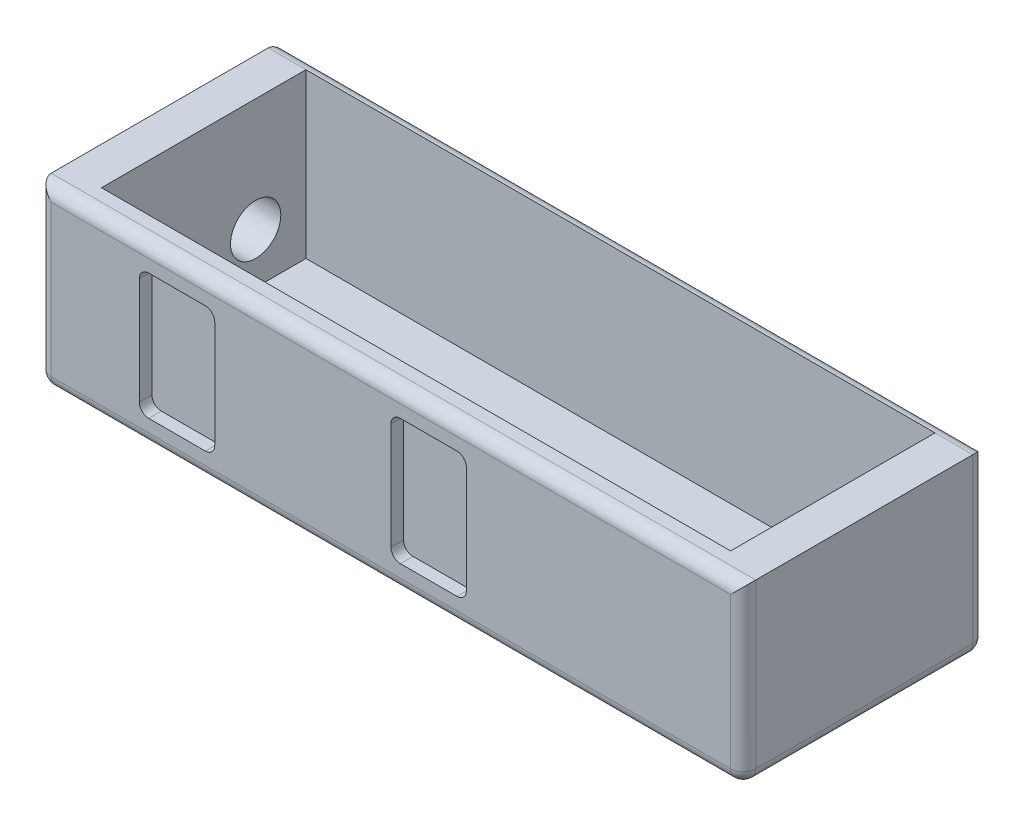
ISO-10303-21;
HEADER;
FILE_DESCRIPTION(('STEP AP214'),'2;1');
FILE_NAME('part.step','',(''),(''),'','','');
FILE_SCHEMA(('AUTOMOTIVE_DESIGN { 1 0 10303 214 1 1 1 1 }'));
ENDSEC;
DATA;
#1=APPLICATION_CONTEXT('core data for automotive mechanical design processes');
#2=APPLICATION_PROTOCOL_DEFINITION('international standard','automotive_design',2000,#1);
#3=PRODUCT_CONTEXT('',#1,'mechanical');
#4=PRODUCT('Part','Part','',(#3));
#5=PRODUCT_RELATED_PRODUCT_CATEGORY('part','',(#4));
#6=PRODUCT_DEFINITION_FORMATION('','',#4);
#7=PRODUCT_DEFINITION_CONTEXT('part definition',#1,'design');
#8=PRODUCT_DEFINITION('design','',#6,#7);
#9=PRODUCT_DEFINITION_SHAPE('','',#8);
#10=(LENGTH_UNIT() NAMED_UNIT(*) SI_UNIT(.MILLI.,.METRE.));
#11=(NAMED_UNIT(*) PLANE_ANGLE_UNIT() SI_UNIT($,.RADIAN.));
#12=(NAMED_UNIT(*) SI_UNIT($,.STERADIAN.) SOLID_ANGLE_UNIT());
#13=UNCERTAINTY_MEASURE_WITH_UNIT(LENGTH_MEASURE(1.E-05),#10,'distance_accuracy_value','');
#14=(GEOMETRIC_REPRESENTATION_CONTEXT(3) GLOBAL_UNCERTAINTY_ASSIGNED_CONTEXT((#13)) GLOBAL_UNIT_ASSIGNED_CONTEXT((#10,
#11,#12)) REPRESENTATION_CONTEXT('',''));
#15=CARTESIAN_POINT('',(0.,0.,0.));
#16=DIRECTION('',(0.,0.,1.));
#17=DIRECTION('',(1.,0.,0.));
#18=AXIS2_PLACEMENT_3D('',#15,#16,#17);
#19=CARTESIAN_POINT('',(177.8,6.35,-61.11875));
#20=DIRECTION('',(-1.,0.,0.));
#21=DIRECTION('',(0.,0.,1.));
#22=AXIS2_PLACEMENT_3D('',#19,#20,#21);
#23=PLANE('',#22);
#24=DIRECTION('',(0.,0.,-1.));
#25=VECTOR('',#24,1.);
#26=CARTESIAN_POINT('',(177.8,6.35,-61.11875));
#27=LINE('',#26,#25);
#28=CARTESIAN_POINT('',(177.8,6.35,54.76875));
#29=VERTEX_POINT('',#28);
#30=CARTESIAN_POINT('',(177.8,6.35,-54.76875));
#31=VERTEX_POINT('',#30);
#32=EDGE_CURVE('E448',#29,#31,#27,.T.);
#33=ORIENTED_EDGE('',*,*,#32,.T.);
#34=DIRECTION('',(0.,-1.,0.));
#35=VECTOR('',#34,1.);
#36=CARTESIAN_POINT('',(177.8,6.35,-54.76875));
#37=LINE('',#36,#35);
#38=CARTESIAN_POINT('',(177.8,88.9,-54.76875));
#39=VERTEX_POINT('',#38);
#40=EDGE_CURVE('E450',#31,#39,#37,.F.);
#41=ORIENTED_EDGE('',*,*,#40,.T.);
#42=DIRECTION('',(0.,0.,-1.));
#43=VECTOR('',#42,1.);
#44=CARTESIAN_POINT('',(177.8,88.9,-61.11875));
#45=LINE('',#44,#43);
#46=CARTESIAN_POINT('',(177.8,88.9,54.76875));
#47=VERTEX_POINT('',#46);
#48=EDGE_CURVE('E399',#47,#39,#45,.T.);
#49=ORIENTED_EDGE('',*,*,#48,.F.);
#50=DIRECTION('',(0.,-1.,0.));
#51=VECTOR('',#50,1.);
#52=CARTESIAN_POINT('',(177.8,6.35,54.76875));
#53=LINE('',#52,#51);
#54=EDGE_CURVE('E446',#47,#29,#53,.T.);
#55=ORIENTED_EDGE('',*,*,#54,.T.);
#56=EDGE_LOOP('',(#33,#41,#49,#55));
#57=FACE_BOUND('',#56,.T.);
#58=ADVANCED_FACE('F32',(#57),#23,.F.);
#59=CARTESIAN_POINT('',(-177.8,6.35,-61.11875));
#60=DIRECTION('',(0.,0.,1.));
#61=DIRECTION('',(1.,0.,0.));
#62=AXIS2_PLACEMENT_3D('',#59,#60,#61);
#63=PLANE('',#62);
#64=DIRECTION('',(-1.,0.,0.));
#65=VECTOR('',#64,1.);
#66=CARTESIAN_POINT('',(-177.8,6.35,-61.11875));
#67=LINE('',#66,#65);
#68=CARTESIAN_POINT('',(171.45,6.35,-61.11875));
#69=VERTEX_POINT('',#68);
#70=CARTESIAN_POINT('',(-171.45,6.35,-61.11875));
#71=VERTEX_POINT('',#70);
#72=EDGE_CURVE('E429',#69,#71,#67,.T.);
#73=ORIENTED_EDGE('',*,*,#72,.T.);
#74=DIRECTION('',(0.,-1.,0.));
#75=VECTOR('',#74,1.);
#76=CARTESIAN_POINT('',(-171.45,6.35,-61.11875));
#77=LINE('',#76,#75);
#78=CARTESIAN_POINT('',(-171.45,82.55,-61.11875));
#79=VERTEX_POINT('',#78);
#80=EDGE_CURVE('E431',#71,#79,#77,.F.);
#81=ORIENTED_EDGE('',*,*,#80,.T.);
#82=DIRECTION('',(-1.,0.,0.));
#83=VECTOR('',#82,1.);
#84=CARTESIAN_POINT('',(177.8,82.55,-61.11875));
#85=LINE('',#84,#83);
#86=CARTESIAN_POINT('',(171.45,82.55,-61.11875));
#87=VERTEX_POINT('',#86);
#88=EDGE_CURVE('E414',#79,#87,#85,.F.);
#89=ORIENTED_EDGE('',*,*,#88,.T.);
#90=DIRECTION('',(0.,-1.,0.));
#91=VECTOR('',#90,1.);
#92=CARTESIAN_POINT('',(171.45,6.35,-61.11875));
#93=LINE('',#92,#91);
#94=EDGE_CURVE('E427',#87,#69,#93,.T.);
#95=ORIENTED_EDGE('',*,*,#94,.T.);
#96=EDGE_LOOP('',(#73,#81,#89,#95));
#97=FACE_BOUND('',#96,.T.);
#98=ADVANCED_FACE('F552',(#97),#63,.F.);
#99=CARTESIAN_POINT('',(-177.8,6.35,-61.11875));
#100=DIRECTION('',(1.,0.,0.));
#101=DIRECTION('',(0.,0.,-1.));
#102=AXIS2_PLACEMENT_3D('',#99,#100,#101);
#103=PLANE('',#102);
#104=CARTESIAN_POINT('',(-177.8,31.75,-29.36875));
#105=DIRECTION('',(-1.,0.,0.));
#106=DIRECTION('',(0.,0.,1.));
#107=AXIS2_PLACEMENT_3D('',#104,#105,#106);
#108=CIRCLE('',#107,12.7);
#109=CARTESIAN_POINT('',(-177.8,31.75,-16.66875));
#110=VERTEX_POINT('',#109);
#111=EDGE_CURVE('E363',#110,#110,#108,.T.);
#112=ORIENTED_EDGE('',*,*,#111,.F.);
#113=EDGE_LOOP('',(#112));
#114=FACE_BOUND('',#113,.T.);
#115=DIRECTION('',(0.,0.,1.));
#116=VECTOR('',#115,1.);
#117=CARTESIAN_POINT('',(-177.8,88.9,-61.11875));
#118=LINE('',#117,#116);
#119=CARTESIAN_POINT('',(-177.8,88.9,-54.76875));
#120=VERTEX_POINT('',#119);
#121=CARTESIAN_POINT('',(-177.8,88.9,54.76875));
#122=VERTEX_POINT('',#121);
#123=EDGE_CURVE('E402',#120,#122,#118,.T.);
#124=ORIENTED_EDGE('',*,*,#123,.F.);
#125=DIRECTION('',(0.,-1.,0.));
#126=VECTOR('',#125,1.);
#127=CARTESIAN_POINT('',(-177.8,6.35,-54.76875));
#128=LINE('',#127,#126);
#129=CARTESIAN_POINT('',(-177.8,6.35,-54.76875));
#130=VERTEX_POINT('',#129);
#131=EDGE_CURVE('E424',#120,#130,#128,.T.);
#132=ORIENTED_EDGE('',*,*,#131,.T.);
#133=DIRECTION('',(0.,0.,1.));
#134=VECTOR('',#133,1.);
#135=CARTESIAN_POINT('',(-177.8,6.35,-61.11875));
#136=LINE('',#135,#134);
#137=CARTESIAN_POINT('',(-177.8,6.35,54.76875));
#138=VERTEX_POINT('',#137);
#139=EDGE_CURVE('E422',#130,#138,#136,.T.);
#140=ORIENTED_EDGE('',*,*,#139,.T.);
#141=DIRECTION('',(0.,-1.,0.));
#142=VECTOR('',#141,1.);
#143=CARTESIAN_POINT('',(-177.8,6.35,54.76875));
#144=LINE('',#143,#142);
#145=EDGE_CURVE('E420',#138,#122,#144,.F.);
#146=ORIENTED_EDGE('',*,*,#145,.T.);
#147=EDGE_LOOP('',(#124,#132,#140,#146));
#148=FACE_BOUND('',#147,.T.);
#149=ADVANCED_FACE('F561',(#114,#148),#103,.F.);
#150=CARTESIAN_POINT('',(-177.8,6.35,61.11875));
#151=DIRECTION('',(0.,0.,-1.));
#152=DIRECTION('',(-1.,0.,0.));
#153=AXIS2_PLACEMENT_3D('',#150,#151,#152);
#154=PLANE('',#153);
#155=DIRECTION('',(0.,1.,0.));
#156=VECTOR('',#155,1.);
#157=CARTESIAN_POINT('',(-88.8999999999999,71.4375,61.11875));
#158=LINE('',#157,#156);
#159=CARTESIAN_POINT('',(-88.8999999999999,17.4625,61.11875));
#160=VERTEX_POINT('',#159);
#161=CARTESIAN_POINT('',(-88.8999999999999,71.4375,61.11875));
#162=VERTEX_POINT('',#161);
#163=EDGE_CURVE('E271',#160,#162,#158,.T.);
#164=ORIENTED_EDGE('',*,*,#163,.F.);
#165=CARTESIAN_POINT('',(-93.6625,17.4625,61.11875));
#166=DIRECTION('',(0.,0.,1.));
#167=DIRECTION('',(1.,0.,0.));
#168=AXIS2_PLACEMENT_3D('',#165,#166,#167);
#169=CIRCLE('',#168,4.7625);
#170=CARTESIAN_POINT('',(-93.6625,12.7,61.11875));
#171=VERTEX_POINT('',#170);
#172=EDGE_CURVE('E49',#171,#160,#169,.T.);
#173=ORIENTED_EDGE('',*,*,#172,.F.);
#174=DIRECTION('',(1.,0.,0.));
#175=VECTOR('',#174,1.);
#176=CARTESIAN_POINT('',(-122.2375,12.7,61.11875));
#177=LINE('',#176,#175);
#178=CARTESIAN_POINT('',(-122.2375,12.7,61.11875));
#179=VERTEX_POINT('',#178);
#180=EDGE_CURVE('E251',#179,#171,#177,.T.);
#181=ORIENTED_EDGE('',*,*,#180,.F.);
#182=CARTESIAN_POINT('',(-122.2375,17.4625,61.11875));
#183=DIRECTION('',(0.,0.,1.));
#184=DIRECTION('',(1.,0.,0.));
#185=AXIS2_PLACEMENT_3D('',#182,#183,#184);
#186=CIRCLE('',#185,4.76250000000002);
#187=CARTESIAN_POINT('',(-127.,17.4625,61.11875));
#188=VERTEX_POINT('',#187);
#189=EDGE_CURVE('E254',#188,#179,#186,.T.);
#190=ORIENTED_EDGE('',*,*,#189,.F.);
#191=DIRECTION('',(0.,-1.,0.));
#192=VECTOR('',#191,1.);
#193=CARTESIAN_POINT('',(-127.,71.4375,61.11875));
#194=LINE('',#193,#192);
#195=CARTESIAN_POINT('',(-127.,71.4375,61.11875));
#196=VERTEX_POINT('',#195);
#197=EDGE_CURVE('E283',#196,#188,#194,.T.);
#198=ORIENTED_EDGE('',*,*,#197,.F.);
#199=CARTESIAN_POINT('',(-122.2375,71.4375,61.11875));
#200=DIRECTION('',(0.,0.,1.));
#201=DIRECTION('',(1.,0.,0.));
#202=AXIS2_PLACEMENT_3D('',#199,#200,#201);
#203=CIRCLE('',#202,4.7625);
#204=CARTESIAN_POINT('',(-122.2375,76.2,61.11875));
#205=VERTEX_POINT('',#204);
#206=EDGE_CURVE('E280',#205,#196,#203,.T.);
#207=ORIENTED_EDGE('',*,*,#206,.F.);
#208=DIRECTION('',(-1.,0.,0.));
#209=VECTOR('',#208,1.);
#210=CARTESIAN_POINT('',(-122.2375,76.2,61.11875));
#211=LINE('',#210,#209);
#212=CARTESIAN_POINT('',(-93.6625,76.2,61.11875));
#213=VERTEX_POINT('',#212);
#214=EDGE_CURVE('E277',#213,#205,#211,.T.);
#215=ORIENTED_EDGE('',*,*,#214,.F.);
#216=CARTESIAN_POINT('',(-93.6625,71.4375,61.11875));
#217=DIRECTION('',(0.,0.,1.));
#218=DIRECTION('',(-1.,0.,0.));
#219=AXIS2_PLACEMENT_3D('',#216,#217,#218);
#220=CIRCLE('',#219,4.7625);
#221=EDGE_CURVE('E274',#162,#213,#220,.T.);
#222=ORIENTED_EDGE('',*,*,#221,.F.);
#223=EDGE_LOOP('',(#164,#173,#181,#190,#198,#207,#215,#222));
#224=FACE_BOUND('',#223,.T.);
#225=DIRECTION('',(0.,1.,0.));
#226=VECTOR('',#225,1.);
#227=CARTESIAN_POINT('',(38.1,71.4375,61.11875));
#228=LINE('',#227,#226);
#229=CARTESIAN_POINT('',(38.1,17.4625,61.11875));
#230=VERTEX_POINT('',#229);
#231=CARTESIAN_POINT('',(38.1,71.4375,61.11875));
#232=VERTEX_POINT('',#231);
#233=EDGE_CURVE('E329',#230,#232,#228,.T.);
#234=ORIENTED_EDGE('',*,*,#233,.F.);
#235=CARTESIAN_POINT('',(33.3375,17.4625,61.11875));
#236=DIRECTION('',(0.,0.,1.));
#237=DIRECTION('',(1.,0.,0.));
#238=AXIS2_PLACEMENT_3D('',#235,#236,#237);
#239=CIRCLE('',#238,4.7625);
#240=CARTESIAN_POINT('',(33.3375,12.7,61.11875));
#241=VERTEX_POINT('',#240);
#242=EDGE_CURVE('E57',#241,#230,#239,.T.);
#243=ORIENTED_EDGE('',*,*,#242,.F.);
#244=DIRECTION('',(1.,0.,0.));
#245=VECTOR('',#244,1.);
#246=CARTESIAN_POINT('',(4.76250000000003,12.7,61.11875));
#247=LINE('',#246,#245);
#248=CARTESIAN_POINT('',(4.76250000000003,12.7,61.11875));
#249=VERTEX_POINT('',#248);
#250=EDGE_CURVE('E306',#249,#241,#247,.T.);
#251=ORIENTED_EDGE('',*,*,#250,.F.);
#252=CARTESIAN_POINT('',(4.7625,17.4625,61.11875));
#253=DIRECTION('',(0.,0.,1.));
#254=DIRECTION('',(1.,0.,0.));
#255=AXIS2_PLACEMENT_3D('',#252,#253,#254);
#256=CIRCLE('',#255,4.7625);
#257=CARTESIAN_POINT('',(0.,17.4625,61.11875));
#258=VERTEX_POINT('',#257);
#259=EDGE_CURVE('E344',#258,#249,#256,.T.);
#260=ORIENTED_EDGE('',*,*,#259,.F.);
#261=DIRECTION('',(0.,-1.,0.));
#262=VECTOR('',#261,1.);
#263=CARTESIAN_POINT('',(0.,71.4375,61.11875));
#264=LINE('',#263,#262);
#265=CARTESIAN_POINT('',(0.,71.4375,61.11875));
#266=VERTEX_POINT('',#265);
#267=EDGE_CURVE('E341',#266,#258,#264,.T.);
#268=ORIENTED_EDGE('',*,*,#267,.F.);
#269=CARTESIAN_POINT('',(4.7625,71.4375,61.11875));
#270=DIRECTION('',(0.,0.,1.));
#271=DIRECTION('',(1.,0.,0.));
#272=AXIS2_PLACEMENT_3D('',#269,#270,#271);
#273=CIRCLE('',#272,4.7625);
#274=CARTESIAN_POINT('',(4.76250000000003,76.2,61.11875));
#275=VERTEX_POINT('',#274);
#276=EDGE_CURVE('E338',#275,#266,#273,.T.);
#277=ORIENTED_EDGE('',*,*,#276,.F.);
#278=DIRECTION('',(-1.,0.,0.));
#279=VECTOR('',#278,1.);
#280=CARTESIAN_POINT('',(4.76250000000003,76.2,61.11875));
#281=LINE('',#280,#279);
#282=CARTESIAN_POINT('',(33.3375,76.2,61.11875));
#283=VERTEX_POINT('',#282);
#284=EDGE_CURVE('E335',#283,#275,#281,.T.);
#285=ORIENTED_EDGE('',*,*,#284,.F.);
#286=CARTESIAN_POINT('',(33.3375,71.4375,61.11875));
#287=DIRECTION('',(0.,0.,1.));
#288=DIRECTION('',(-1.,0.,0.));
#289=AXIS2_PLACEMENT_3D('',#286,#287,#288);
#290=CIRCLE('',#289,4.7625);
#291=EDGE_CURVE('E332',#232,#283,#290,.T.);
#292=ORIENTED_EDGE('',*,*,#291,.F.);
#293=EDGE_LOOP('',(#234,#243,#251,#260,#268,#277,#285,#292));
#294=FACE_BOUND('',#293,.T.);
#295=DIRECTION('',(1.,0.,0.));
#296=VECTOR('',#295,1.);
#297=CARTESIAN_POINT('',(-177.8,6.35,61.11875));
#298=LINE('',#297,#296);
#299=CARTESIAN_POINT('',(-171.45,6.35,61.11875));
#300=VERTEX_POINT('',#299);
#301=CARTESIAN_POINT('',(171.45,6.35,61.11875));
#302=VERTEX_POINT('',#301);
#303=EDGE_CURVE('E454',#300,#302,#298,.T.);
#304=ORIENTED_EDGE('',*,*,#303,.T.);
#305=DIRECTION('',(0.,-1.,0.));
#306=VECTOR('',#305,1.);
#307=CARTESIAN_POINT('',(171.45,6.35,61.11875));
#308=LINE('',#307,#306);
#309=CARTESIAN_POINT('',(171.45,82.55,61.11875));
#310=VERTEX_POINT('',#309);
#311=EDGE_CURVE('E456',#302,#310,#308,.F.);
#312=ORIENTED_EDGE('',*,*,#311,.T.);
#313=DIRECTION('',(1.,0.,0.));
#314=VECTOR('',#313,1.);
#315=CARTESIAN_POINT('',(-177.8,82.55,61.11875));
#316=LINE('',#315,#314);
#317=CARTESIAN_POINT('',(-171.45,82.55,61.11875));
#318=VERTEX_POINT('',#317);
#319=EDGE_CURVE('E417',#310,#318,#316,.F.);
#320=ORIENTED_EDGE('',*,*,#319,.T.);
#321=DIRECTION('',(0.,-1.,0.));
#322=VECTOR('',#321,1.);
#323=CARTESIAN_POINT('',(-171.45,6.35,61.11875));
#324=LINE('',#323,#322);
#325=EDGE_CURVE('E452',#318,#300,#324,.T.);
#326=ORIENTED_EDGE('',*,*,#325,.T.);
#327=EDGE_LOOP('',(#304,#312,#320,#326));
#328=FACE_BOUND('',#327,.T.);
#329=ADVANCED_FACE('F503',(#224,#294,#328),#154,.F.);
#330=CARTESIAN_POINT('',(0.,0.,0.));
#331=DIRECTION('',(0.,1.,0.));
#332=DIRECTION('',(0.,0.,1.));
#333=AXIS2_PLACEMENT_3D('',#330,#331,#332);
#334=PLANE('',#333);
#335=DIRECTION('',(0.,0.,1.));
#336=VECTOR('',#335,1.);
#337=CARTESIAN_POINT('',(-171.45,0.,0.));
#338=LINE('',#337,#336);
#339=CARTESIAN_POINT('',(-171.45,0.,54.76875));
#340=VERTEX_POINT('',#339);
#341=CARTESIAN_POINT('',(-171.45,0.,-54.76875));
#342=VERTEX_POINT('',#341);
#343=EDGE_CURVE('E439',#340,#342,#338,.F.);
#344=ORIENTED_EDGE('',*,*,#343,.T.);
#345=DIRECTION('',(-1.,0.,0.));
#346=VECTOR('',#345,1.);
#347=CARTESIAN_POINT('',(0.,0.,-54.76875));
#348=LINE('',#347,#346);
#349=CARTESIAN_POINT('',(171.45,0.,-54.76875));
#350=VERTEX_POINT('',#349);
#351=EDGE_CURVE('E443',#342,#350,#348,.F.);
#352=ORIENTED_EDGE('',*,*,#351,.T.);
#353=DIRECTION('',(0.,0.,-1.));
#354=VECTOR('',#353,1.);
#355=CARTESIAN_POINT('',(171.45,0.,0.));
#356=LINE('',#355,#354);
#357=CARTESIAN_POINT('',(171.45,0.,54.76875));
#358=VERTEX_POINT('',#357);
#359=EDGE_CURVE('E441',#350,#358,#356,.F.);
#360=ORIENTED_EDGE('',*,*,#359,.T.);
#361=DIRECTION('',(1.,0.,0.));
#362=VECTOR('',#361,1.);
#363=CARTESIAN_POINT('',(0.,0.,54.76875));
#364=LINE('',#363,#362);
#365=EDGE_CURVE('E437',#358,#340,#364,.F.);
#366=ORIENTED_EDGE('',*,*,#365,.T.);
#367=EDGE_LOOP('',(#344,#352,#360,#366));
#368=FACE_BOUND('',#367,.T.);
#369=ADVANCED_FACE('F525',(#368),#334,.F.);
#370=CARTESIAN_POINT('',(0.,88.9,0.));
#371=DIRECTION('',(0.,1.,0.));
#372=DIRECTION('',(0.,0.,1.));
#373=AXIS2_PLACEMENT_3D('',#370,#371,#372);
#374=PLANE('',#373);
#375=ORIENTED_EDGE('',*,*,#48,.T.);
#376=DIRECTION('',(-1.,0.,0.));
#377=VECTOR('',#376,1.);
#378=CARTESIAN_POINT('',(-177.8,88.9,-54.76875));
#379=LINE('',#378,#377);
#380=CARTESIAN_POINT('',(158.75,88.9,-54.76875));
#381=VERTEX_POINT('',#380);
#382=EDGE_CURVE('E411',#39,#381,#379,.T.);
#383=ORIENTED_EDGE('',*,*,#382,.T.);
#384=DIRECTION('',(0.,0.,-1.));
#385=VECTOR('',#384,1.);
#386=CARTESIAN_POINT('',(158.75,88.9,-54.76875));
#387=LINE('',#386,#385);
#388=CARTESIAN_POINT('',(158.75,88.9,48.41875));
#389=VERTEX_POINT('',#388);
#390=EDGE_CURVE('E370',#389,#381,#387,.T.);
#391=ORIENTED_EDGE('',*,*,#390,.F.);
#392=DIRECTION('',(1.,0.,0.));
#393=VECTOR('',#392,1.);
#394=CARTESIAN_POINT('',(-158.75,88.9,48.41875));
#395=LINE('',#394,#393);
#396=CARTESIAN_POINT('',(-158.75,88.9,48.41875));
#397=VERTEX_POINT('',#396);
#398=EDGE_CURVE('E379',#397,#389,#395,.T.);
#399=ORIENTED_EDGE('',*,*,#398,.F.);
#400=DIRECTION('',(0.,0.,1.));
#401=VECTOR('',#400,1.);
#402=CARTESIAN_POINT('',(-158.75,88.9,-54.76875));
#403=LINE('',#402,#401);
#404=CARTESIAN_POINT('',(-158.75,88.9,-54.76875));
#405=VERTEX_POINT('',#404);
#406=EDGE_CURVE('E376',#405,#397,#403,.T.);
#407=ORIENTED_EDGE('',*,*,#406,.F.);
#408=DIRECTION('',(-1.,0.,0.));
#409=VECTOR('',#408,1.);
#410=CARTESIAN_POINT('',(-177.8,88.9,-54.76875));
#411=LINE('',#410,#409);
#412=EDGE_CURVE('E408',#405,#120,#411,.T.);
#413=ORIENTED_EDGE('',*,*,#412,.T.);
#414=ORIENTED_EDGE('',*,*,#123,.T.);
#415=DIRECTION('',(1.,0.,0.));
#416=VECTOR('',#415,1.);
#417=CARTESIAN_POINT('',(177.8,88.9,54.76875));
#418=LINE('',#417,#416);
#419=EDGE_CURVE('E405',#122,#47,#418,.T.);
#420=ORIENTED_EDGE('',*,*,#419,.T.);
#421=EDGE_LOOP('',(#375,#383,#391,#399,#407,#413,#414,#420));
#422=FACE_BOUND('',#421,.T.);
#423=ADVANCED_FACE('F563',(#422),#374,.T.);
#424=CARTESIAN_POINT('',(158.75,88.9,-54.76875));
#425=DIRECTION('',(-1.,0.,0.));
#426=DIRECTION('',(0.,0.,1.));
#427=AXIS2_PLACEMENT_3D('',#424,#425,#426);
#428=PLANE('',#427);
#429=DIRECTION('',(0.,0.,-1.));
#430=VECTOR('',#429,1.);
#431=CARTESIAN_POINT('',(158.75,6.35,-54.76875));
#432=LINE('',#431,#430);
#433=CARTESIAN_POINT('',(158.75,6.35,48.41875));
#434=VERTEX_POINT('',#433);
#435=CARTESIAN_POINT('',(158.75,6.35,-54.76875));
#436=VERTEX_POINT('',#435);
#437=EDGE_CURVE('E366',#434,#436,#432,.T.);
#438=ORIENTED_EDGE('',*,*,#437,.F.);
#439=DIRECTION('',(0.,-1.,0.));
#440=VECTOR('',#439,1.);
#441=CARTESIAN_POINT('',(158.75,88.9,48.41875));
#442=LINE('',#441,#440);
#443=EDGE_CURVE('E381',#389,#434,#442,.T.);
#444=ORIENTED_EDGE('',*,*,#443,.F.);
#445=ORIENTED_EDGE('',*,*,#390,.T.);
#446=DIRECTION('',(0.,-1.,0.));
#447=VECTOR('',#446,1.);
#448=CARTESIAN_POINT('',(158.75,88.9,-54.76875));
#449=LINE('',#448,#447);
#450=EDGE_CURVE('E396',#381,#436,#449,.T.);
#451=ORIENTED_EDGE('',*,*,#450,.T.);
#452=EDGE_LOOP('',(#438,#444,#445,#451));
#453=FACE_BOUND('',#452,.T.);
#454=ADVANCED_FACE('F574',(#453),#428,.T.);
#455=CARTESIAN_POINT('',(-158.75,88.9,-54.76875));
#456=DIRECTION('',(0.,0.,1.));
#457=DIRECTION('',(1.,0.,0.));
#458=AXIS2_PLACEMENT_3D('',#455,#456,#457);
#459=PLANE('',#458);
#460=DIRECTION('',(-1.,0.,0.));
#461=VECTOR('',#460,1.);
#462=CARTESIAN_POINT('',(-158.75,6.35,-54.76875));
#463=LINE('',#462,#461);
#464=CARTESIAN_POINT('',(-158.75,6.35,-54.76875));
#465=VERTEX_POINT('',#464);
#466=EDGE_CURVE('E383',#436,#465,#463,.T.);
#467=ORIENTED_EDGE('',*,*,#466,.F.);
#468=ORIENTED_EDGE('',*,*,#450,.F.);
#469=DIRECTION('',(-1.,0.,0.));
#470=VECTOR('',#469,1.);
#471=CARTESIAN_POINT('',(-158.75,88.9,-54.76875));
#472=LINE('',#471,#470);
#473=EDGE_CURVE('E373',#381,#405,#472,.T.);
#474=ORIENTED_EDGE('',*,*,#473,.T.);
#475=DIRECTION('',(0.,-1.,0.));
#476=VECTOR('',#475,1.);
#477=CARTESIAN_POINT('',(-158.75,88.9,-54.76875));
#478=LINE('',#477,#476);
#479=EDGE_CURVE('E393',#405,#465,#478,.T.);
#480=ORIENTED_EDGE('',*,*,#479,.T.);
#481=EDGE_LOOP('',(#467,#468,#474,#480));
#482=FACE_BOUND('',#481,.T.);
#483=ADVANCED_FACE('F576',(#482),#459,.T.);
#484=CARTESIAN_POINT('',(-158.75,88.9,-54.76875));
#485=DIRECTION('',(1.,0.,0.));
#486=DIRECTION('',(0.,0.,-1.));
#487=AXIS2_PLACEMENT_3D('',#484,#485,#486);
#488=PLANE('',#487);
#489=CARTESIAN_POINT('',(-158.75,31.75,-29.36875));
#490=DIRECTION('',(1.,0.,0.));
#491=DIRECTION('',(0.,0.,-1.));
#492=AXIS2_PLACEMENT_3D('',#489,#490,#491);
#493=CIRCLE('',#492,12.7);
#494=CARTESIAN_POINT('',(-158.75,31.75,-42.06875));
#495=VERTEX_POINT('',#494);
#496=EDGE_CURVE('E367',#495,#495,#493,.F.);
#497=ORIENTED_EDGE('',*,*,#496,.T.);
#498=EDGE_LOOP('',(#497));
#499=FACE_BOUND('',#498,.T.);
#500=DIRECTION('',(0.,0.,1.));
#501=VECTOR('',#500,1.);
#502=CARTESIAN_POINT('',(-158.75,6.35,-54.76875));
#503=LINE('',#502,#501);
#504=CARTESIAN_POINT('',(-158.75,6.35,48.41875));
#505=VERTEX_POINT('',#504);
#506=EDGE_CURVE('E385',#465,#505,#503,.T.);
#507=ORIENTED_EDGE('',*,*,#506,.F.);
#508=ORIENTED_EDGE('',*,*,#479,.F.);
#509=ORIENTED_EDGE('',*,*,#406,.T.);
#510=DIRECTION('',(0.,-1.,0.));
#511=VECTOR('',#510,1.);
#512=CARTESIAN_POINT('',(-158.75,88.9,48.41875));
#513=LINE('',#512,#511);
#514=EDGE_CURVE('E390',#397,#505,#513,.T.);
#515=ORIENTED_EDGE('',*,*,#514,.T.);
#516=EDGE_LOOP('',(#507,#508,#509,#515));
#517=FACE_BOUND('',#516,.T.);
#518=ADVANCED_FACE('F584',(#499,#517),#488,.T.);
#519=CARTESIAN_POINT('',(-158.75,88.9,48.41875));
#520=DIRECTION('',(0.,0.,-1.));
#521=DIRECTION('',(-1.,0.,0.));
#522=AXIS2_PLACEMENT_3D('',#519,#520,#521);
#523=PLANE('',#522);
#524=DIRECTION('',(1.,0.,0.));
#525=VECTOR('',#524,1.);
#526=CARTESIAN_POINT('',(-158.75,6.35,48.41875));
#527=LINE('',#526,#525);
#528=EDGE_CURVE('E374',#505,#434,#527,.T.);
#529=ORIENTED_EDGE('',*,*,#528,.F.);
#530=ORIENTED_EDGE('',*,*,#514,.F.);
#531=ORIENTED_EDGE('',*,*,#398,.T.);
#532=ORIENTED_EDGE('',*,*,#443,.T.);
#533=EDGE_LOOP('',(#529,#530,#531,#532));
#534=FACE_BOUND('',#533,.T.);
#535=ADVANCED_FACE('F582',(#534),#523,.T.);
#536=CARTESIAN_POINT('',(0.,6.35,0.));
#537=DIRECTION('',(0.,1.,0.));
#538=DIRECTION('',(0.,0.,1.));
#539=AXIS2_PLACEMENT_3D('',#536,#537,#538);
#540=PLANE('',#539);
#541=ORIENTED_EDGE('',*,*,#437,.T.);
#542=ORIENTED_EDGE('',*,*,#466,.T.);
#543=ORIENTED_EDGE('',*,*,#506,.T.);
#544=ORIENTED_EDGE('',*,*,#528,.T.);
#545=EDGE_LOOP('',(#541,#542,#543,#544));
#546=FACE_BOUND('',#545,.T.);
#547=ADVANCED_FACE('F579',(#546),#540,.T.);
#548=CARTESIAN_POINT('',(0.,82.55,-54.76875));
#549=DIRECTION('',(1.,0.,0.));
#550=DIRECTION('',(0.,0.,-1.));
#551=AXIS2_PLACEMENT_3D('',#548,#549,#550);
#552=CYLINDRICAL_SURFACE('',#551,6.35);
#553=ORIENTED_EDGE('',*,*,#88,.F.);
#554=CARTESIAN_POINT('',(-171.45,82.55,-54.76875));
#555=DIRECTION('',(0.707106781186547,0.707106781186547,0.));
#556=DIRECTION('',(0.707106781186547,-0.707106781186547,0.));
#557=AXIS2_PLACEMENT_3D('',#554,#555,#556);
#558=ELLIPSE('',#557,8.98025612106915,6.35);
#559=EDGE_CURVE('E435',#79,#120,#558,.T.);
#560=ORIENTED_EDGE('',*,*,#559,.T.);
#561=ORIENTED_EDGE('',*,*,#412,.F.);
#562=ORIENTED_EDGE('',*,*,#473,.F.);
#563=ORIENTED_EDGE('',*,*,#382,.F.);
#564=CARTESIAN_POINT('',(171.45,82.55,-54.76875));
#565=DIRECTION('',(0.707106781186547,-0.707106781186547,0.));
#566=DIRECTION('',(0.707106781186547,0.707106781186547,0.));
#567=AXIS2_PLACEMENT_3D('',#564,#565,#566);
#568=ELLIPSE('',#567,8.98025612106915,6.35);
#569=EDGE_CURVE('E433',#39,#87,#568,.F.);
#570=ORIENTED_EDGE('',*,*,#569,.T.);
#571=EDGE_LOOP('',(#553,#560,#561,#562,#563,#570));
#572=FACE_BOUND('',#571,.T.);
#573=ADVANCED_FACE('F549',(#572),#552,.T.);
#574=CARTESIAN_POINT('',(0.,82.55,54.76875));
#575=DIRECTION('',(-1.,0.,0.));
#576=DIRECTION('',(0.,0.,1.));
#577=AXIS2_PLACEMENT_3D('',#574,#575,#576);
#578=CYLINDRICAL_SURFACE('',#577,6.35);
#579=ORIENTED_EDGE('',*,*,#319,.F.);
#580=CARTESIAN_POINT('',(171.45,82.55,54.76875));
#581=DIRECTION('',(-0.707106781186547,0.707106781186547,0.));
#582=DIRECTION('',(-0.707106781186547,-0.707106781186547,0.));
#583=AXIS2_PLACEMENT_3D('',#580,#581,#582);
#584=ELLIPSE('',#583,8.98025612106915,6.35);
#585=EDGE_CURVE('E11',#310,#47,#584,.T.);
#586=ORIENTED_EDGE('',*,*,#585,.T.);
#587=ORIENTED_EDGE('',*,*,#419,.F.);
#588=CARTESIAN_POINT('',(-171.45,82.55,54.76875));
#589=DIRECTION('',(-0.707106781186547,-0.707106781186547,0.));
#590=DIRECTION('',(-0.707106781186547,0.707106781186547,0.));
#591=AXIS2_PLACEMENT_3D('',#588,#589,#590);
#592=ELLIPSE('',#591,8.98025612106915,6.35);
#593=EDGE_CURVE('E41',#122,#318,#592,.F.);
#594=ORIENTED_EDGE('',*,*,#593,.T.);
#595=EDGE_LOOP('',(#579,#586,#587,#594));
#596=FACE_BOUND('',#595,.T.);
#597=ADVANCED_FACE('F506',(#596),#578,.T.);
#598=CARTESIAN_POINT('',(177.801,31.75,-29.3687500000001));
#599=DIRECTION('',(-1.,0.,0.));
#600=DIRECTION('',(0.,0.,1.));
#601=AXIS2_PLACEMENT_3D('',#598,#599,#600);
#602=CYLINDRICAL_SURFACE('',#601,12.7);
#603=ORIENTED_EDGE('',*,*,#496,.F.);
#604=EDGE_LOOP('',(#603));
#605=FACE_BOUND('',#604,.T.);
#606=ORIENTED_EDGE('',*,*,#111,.T.);
#607=EDGE_LOOP('',(#606));
#608=FACE_BOUND('',#607,.T.);
#609=ADVANCED_FACE('F606',(#605,#608),#602,.F.);
#610=CARTESIAN_POINT('',(171.45,6.35,54.76875));
#611=DIRECTION('',(0.,-1.,0.));
#612=DIRECTION('',(0.,0.,-1.));
#613=AXIS2_PLACEMENT_3D('',#610,#611,#612);
#614=CYLINDRICAL_SURFACE('',#613,6.35);
#615=CARTESIAN_POINT('',(171.45,6.35,54.76875));
#616=DIRECTION('',(0.,-1.,0.));
#617=DIRECTION('',(0.,0.,-1.));
#618=AXIS2_PLACEMENT_3D('',#615,#616,#617);
#619=CIRCLE('',#618,6.35);
#620=EDGE_CURVE('E36',#29,#302,#619,.T.);
#621=ORIENTED_EDGE('',*,*,#620,.F.);
#622=ORIENTED_EDGE('',*,*,#54,.F.);
#623=ORIENTED_EDGE('',*,*,#585,.F.);
#624=ORIENTED_EDGE('',*,*,#311,.F.);
#625=EDGE_LOOP('',(#621,#622,#623,#624));
#626=FACE_BOUND('',#625,.T.);
#627=ADVANCED_FACE('F34',(#626),#614,.T.);
#628=CARTESIAN_POINT('',(171.45,6.35,54.76875));
#629=DIRECTION('',(0.,0.,1.));
#630=DIRECTION('',(1.,0.,0.));
#631=AXIS2_PLACEMENT_3D('',#628,#629,#630);
#632=SPHERICAL_SURFACE('',#631,6.35);
#633=CARTESIAN_POINT('',(171.45,6.35,54.76875));
#634=DIRECTION('',(0.,0.,1.));
#635=DIRECTION('',(1.,0.,0.));
#636=AXIS2_PLACEMENT_3D('',#633,#634,#635);
#637=CIRCLE('',#636,6.35);
#638=EDGE_CURVE('E483',#29,#358,#637,.F.);
#639=ORIENTED_EDGE('',*,*,#638,.F.);
#640=ORIENTED_EDGE('',*,*,#620,.T.);
#641=CARTESIAN_POINT('',(171.45,6.35,54.76875));
#642=DIRECTION('',(1.,0.,0.));
#643=DIRECTION('',(0.,0.,-1.));
#644=AXIS2_PLACEMENT_3D('',#641,#642,#643);
#645=CIRCLE('',#644,6.35);
#646=EDGE_CURVE('E485',#358,#302,#645,.F.);
#647=ORIENTED_EDGE('',*,*,#646,.F.);
#648=EDGE_LOOP('',(#639,#640,#647));
#649=FACE_BOUND('',#648,.T.);
#650=ADVANCED_FACE('F495',(#649),#632,.T.);
#651=CARTESIAN_POINT('',(-171.45,6.35,54.76875));
#652=DIRECTION('',(0.,-1.,0.));
#653=DIRECTION('',(0.,0.,-1.));
#654=AXIS2_PLACEMENT_3D('',#651,#652,#653);
#655=CYLINDRICAL_SURFACE('',#654,6.35);
#656=ORIENTED_EDGE('',*,*,#593,.F.);
#657=ORIENTED_EDGE('',*,*,#145,.F.);
#658=CARTESIAN_POINT('',(-171.45,6.35,54.76875));
#659=DIRECTION('',(0.,-1.,0.));
#660=DIRECTION('',(0.,0.,-1.));
#661=AXIS2_PLACEMENT_3D('',#658,#659,#660);
#662=CIRCLE('',#661,6.35);
#663=EDGE_CURVE('E480',#300,#138,#662,.T.);
#664=ORIENTED_EDGE('',*,*,#663,.F.);
#665=ORIENTED_EDGE('',*,*,#325,.F.);
#666=EDGE_LOOP('',(#656,#657,#664,#665));
#667=FACE_BOUND('',#666,.T.);
#668=ADVANCED_FACE('F511',(#667),#655,.T.);
#669=CARTESIAN_POINT('',(-177.8,6.35,54.76875));
#670=DIRECTION('',(1.,0.,0.));
#671=DIRECTION('',(0.,0.,-1.));
#672=AXIS2_PLACEMENT_3D('',#669,#670,#671);
#673=CYLINDRICAL_SURFACE('',#672,6.35);
#674=ORIENTED_EDGE('',*,*,#646,.T.);
#675=ORIENTED_EDGE('',*,*,#303,.F.);
#676=CARTESIAN_POINT('',(-171.45,6.35,54.76875));
#677=DIRECTION('',(-1.,0.,0.));
#678=DIRECTION('',(0.,0.,1.));
#679=AXIS2_PLACEMENT_3D('',#676,#677,#678);
#680=CIRCLE('',#679,6.35);
#681=EDGE_CURVE('E477',#340,#300,#680,.T.);
#682=ORIENTED_EDGE('',*,*,#681,.F.);
#683=ORIENTED_EDGE('',*,*,#365,.F.);
#684=EDGE_LOOP('',(#674,#675,#682,#683));
#685=FACE_BOUND('',#684,.T.);
#686=ADVANCED_FACE('F514',(#685),#673,.T.);
#687=CARTESIAN_POINT('',(171.45,6.35,-61.11875));
#688=DIRECTION('',(0.,0.,-1.));
#689=DIRECTION('',(-1.,0.,0.));
#690=AXIS2_PLACEMENT_3D('',#687,#688,#689);
#691=CYLINDRICAL_SURFACE('',#690,6.35);
#692=ORIENTED_EDGE('',*,*,#638,.T.);
#693=ORIENTED_EDGE('',*,*,#359,.F.);
#694=CARTESIAN_POINT('',(171.45,6.35,-54.76875));
#695=DIRECTION('',(0.,0.,-1.));
#696=DIRECTION('',(-1.,0.,0.));
#697=AXIS2_PLACEMENT_3D('',#694,#695,#696);
#698=CIRCLE('',#697,6.35);
#699=EDGE_CURVE('E474',#31,#350,#698,.T.);
#700=ORIENTED_EDGE('',*,*,#699,.F.);
#701=ORIENTED_EDGE('',*,*,#32,.F.);
#702=EDGE_LOOP('',(#692,#693,#700,#701));
#703=FACE_BOUND('',#702,.T.);
#704=ADVANCED_FACE('F538',(#703),#691,.T.);
#705=CARTESIAN_POINT('',(171.45,6.35,-54.76875));
#706=DIRECTION('',(0.,-1.,0.));
#707=DIRECTION('',(0.,0.,-1.));
#708=AXIS2_PLACEMENT_3D('',#705,#706,#707);
#709=CYLINDRICAL_SURFACE('',#708,6.35);
#710=ORIENTED_EDGE('',*,*,#569,.F.);
#711=ORIENTED_EDGE('',*,*,#40,.F.);
#712=CARTESIAN_POINT('',(171.45,6.35,-54.76875));
#713=DIRECTION('',(0.,-1.,0.));
#714=DIRECTION('',(0.,0.,-1.));
#715=AXIS2_PLACEMENT_3D('',#712,#713,#714);
#716=CIRCLE('',#715,6.35);
#717=EDGE_CURVE('E471',#69,#31,#716,.T.);
#718=ORIENTED_EDGE('',*,*,#717,.F.);
#719=ORIENTED_EDGE('',*,*,#94,.F.);
#720=EDGE_LOOP('',(#710,#711,#718,#719));
#721=FACE_BOUND('',#720,.T.);
#722=ADVANCED_FACE('F544',(#721),#709,.T.);
#723=CARTESIAN_POINT('',(-171.45,6.35,54.76875));
#724=DIRECTION('',(0.,0.,1.));
#725=DIRECTION('',(1.,0.,0.));
#726=AXIS2_PLACEMENT_3D('',#723,#724,#725);
#727=SPHERICAL_SURFACE('',#726,6.35);
#728=ORIENTED_EDGE('',*,*,#681,.T.);
#729=ORIENTED_EDGE('',*,*,#663,.T.);
#730=CARTESIAN_POINT('',(-171.45,6.35,54.76875));
#731=DIRECTION('',(0.,0.,1.));
#732=DIRECTION('',(1.,0.,0.));
#733=AXIS2_PLACEMENT_3D('',#730,#731,#732);
#734=CIRCLE('',#733,6.35);
#735=EDGE_CURVE('E468',#340,#138,#734,.F.);
#736=ORIENTED_EDGE('',*,*,#735,.F.);
#737=EDGE_LOOP('',(#728,#729,#736));
#738=FACE_BOUND('',#737,.T.);
#739=ADVANCED_FACE('F518',(#738),#727,.T.);
#740=CARTESIAN_POINT('',(171.45,6.35,-54.76875));
#741=DIRECTION('',(0.,0.,1.));
#742=DIRECTION('',(1.,0.,0.));
#743=AXIS2_PLACEMENT_3D('',#740,#741,#742);
#744=SPHERICAL_SURFACE('',#743,6.35);
#745=ORIENTED_EDGE('',*,*,#717,.T.);
#746=ORIENTED_EDGE('',*,*,#699,.T.);
#747=CARTESIAN_POINT('',(171.45,6.35,-54.76875));
#748=DIRECTION('',(1.,0.,0.));
#749=DIRECTION('',(0.,0.,-1.));
#750=AXIS2_PLACEMENT_3D('',#747,#748,#749);
#751=CIRCLE('',#750,6.35);
#752=EDGE_CURVE('E466',#69,#350,#751,.F.);
#753=ORIENTED_EDGE('',*,*,#752,.F.);
#754=EDGE_LOOP('',(#745,#746,#753));
#755=FACE_BOUND('',#754,.T.);
#756=ADVANCED_FACE('F535',(#755),#744,.T.);
#757=CARTESIAN_POINT('',(-171.45,6.35,-61.11875));
#758=DIRECTION('',(0.,0.,1.));
#759=DIRECTION('',(1.,0.,0.));
#760=AXIS2_PLACEMENT_3D('',#757,#758,#759);
#761=CYLINDRICAL_SURFACE('',#760,6.35);
#762=ORIENTED_EDGE('',*,*,#735,.T.);
#763=ORIENTED_EDGE('',*,*,#139,.F.);
#764=CARTESIAN_POINT('',(-171.45,6.35,-54.76875));
#765=DIRECTION('',(0.,0.,-1.));
#766=DIRECTION('',(-1.,0.,0.));
#767=AXIS2_PLACEMENT_3D('',#764,#765,#766);
#768=CIRCLE('',#767,6.35);
#769=EDGE_CURVE('E463',#342,#130,#768,.T.);
#770=ORIENTED_EDGE('',*,*,#769,.F.);
#771=ORIENTED_EDGE('',*,*,#343,.F.);
#772=EDGE_LOOP('',(#762,#763,#770,#771));
#773=FACE_BOUND('',#772,.T.);
#774=ADVANCED_FACE('F522',(#773),#761,.T.);
#775=CARTESIAN_POINT('',(-177.8,6.35,-54.76875));
#776=DIRECTION('',(-1.,0.,0.));
#777=DIRECTION('',(0.,0.,1.));
#778=AXIS2_PLACEMENT_3D('',#775,#776,#777);
#779=CYLINDRICAL_SURFACE('',#778,6.35);
#780=ORIENTED_EDGE('',*,*,#752,.T.);
#781=ORIENTED_EDGE('',*,*,#351,.F.);
#782=CARTESIAN_POINT('',(-171.45,6.35,-54.76875));
#783=DIRECTION('',(-1.,0.,0.));
#784=DIRECTION('',(0.,0.,1.));
#785=AXIS2_PLACEMENT_3D('',#782,#783,#784);
#786=CIRCLE('',#785,6.35);
#787=EDGE_CURVE('E460',#71,#342,#786,.T.);
#788=ORIENTED_EDGE('',*,*,#787,.F.);
#789=ORIENTED_EDGE('',*,*,#72,.F.);
#790=EDGE_LOOP('',(#780,#781,#788,#789));
#791=FACE_BOUND('',#790,.T.);
#792=ADVANCED_FACE('F528',(#791),#779,.T.);
#793=CARTESIAN_POINT('',(-171.45,6.35,-54.76875));
#794=DIRECTION('',(0.,0.,1.));
#795=DIRECTION('',(1.,0.,0.));
#796=AXIS2_PLACEMENT_3D('',#793,#794,#795);
#797=SPHERICAL_SURFACE('',#796,6.35);
#798=ORIENTED_EDGE('',*,*,#787,.T.);
#799=ORIENTED_EDGE('',*,*,#769,.T.);
#800=CARTESIAN_POINT('',(-171.45,6.35,-54.76875));
#801=DIRECTION('',(0.,-1.,0.));
#802=DIRECTION('',(0.,0.,-1.));
#803=AXIS2_PLACEMENT_3D('',#800,#801,#802);
#804=CIRCLE('',#803,6.35);
#805=EDGE_CURVE('E290',#71,#130,#804,.F.);
#806=ORIENTED_EDGE('',*,*,#805,.F.);
#807=EDGE_LOOP('',(#798,#799,#806));
#808=FACE_BOUND('',#807,.T.);
#809=ADVANCED_FACE('F558',(#808),#797,.T.);
#810=CARTESIAN_POINT('',(-171.45,6.35,-54.76875));
#811=DIRECTION('',(0.,-1.,0.));
#812=DIRECTION('',(0.,0.,-1.));
#813=AXIS2_PLACEMENT_3D('',#810,#811,#812);
#814=CYLINDRICAL_SURFACE('',#813,6.35);
#815=ORIENTED_EDGE('',*,*,#559,.F.);
#816=ORIENTED_EDGE('',*,*,#80,.F.);
#817=ORIENTED_EDGE('',*,*,#805,.T.);
#818=ORIENTED_EDGE('',*,*,#131,.F.);
#819=EDGE_LOOP('',(#815,#816,#817,#818));
#820=FACE_BOUND('',#819,.T.);
#821=ADVANCED_FACE('F555',(#820),#814,.T.);
#822=CARTESIAN_POINT('',(33.3375,17.4625,54.76875));
#823=DIRECTION('',(0.,0.,1.));
#824=DIRECTION('',(1.,0.,0.));
#825=AXIS2_PLACEMENT_3D('',#822,#823,#824);
#826=CYLINDRICAL_SURFACE('',#825,4.7625);
#827=ORIENTED_EDGE('',*,*,#242,.T.);
#828=DIRECTION('',(0.,0.,1.));
#829=VECTOR('',#828,1.);
#830=CARTESIAN_POINT('',(38.1,17.4625,54.76875));
#831=LINE('',#830,#829);
#832=CARTESIAN_POINT('',(38.1,17.4625,54.76875));
#833=VERTEX_POINT('',#832);
#834=EDGE_CURVE('E327',#833,#230,#831,.T.);
#835=ORIENTED_EDGE('',*,*,#834,.F.);
#836=CARTESIAN_POINT('',(33.3375,17.4625,54.76875));
#837=DIRECTION('',(0.,0.,1.));
#838=DIRECTION('',(1.,0.,0.));
#839=AXIS2_PLACEMENT_3D('',#836,#837,#838);
#840=CIRCLE('',#839,4.7625);
#841=CARTESIAN_POINT('',(33.3375,12.7,54.76875));
#842=VERTEX_POINT('',#841);
#843=EDGE_CURVE('E302',#842,#833,#840,.T.);
#844=ORIENTED_EDGE('',*,*,#843,.F.);
#845=DIRECTION('',(0.,0.,1.));
#846=VECTOR('',#845,1.);
#847=CARTESIAN_POINT('',(33.3375,12.7,54.76875));
#848=LINE('',#847,#846);
#849=EDGE_CURVE('E272',#842,#241,#848,.T.);
#850=ORIENTED_EDGE('',*,*,#849,.T.);
#851=EDGE_LOOP('',(#827,#835,#844,#850));
#852=FACE_BOUND('',#851,.T.);
#853=ADVANCED_FACE('F609',(#852),#826,.F.);
#854=CARTESIAN_POINT('',(4.76250000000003,12.7,54.76875));
#855=DIRECTION('',(0.,-1.,0.));
#856=DIRECTION('',(0.,0.,-1.));
#857=AXIS2_PLACEMENT_3D('',#854,#855,#856);
#858=PLANE('',#857);
#859=ORIENTED_EDGE('',*,*,#250,.T.);
#860=ORIENTED_EDGE('',*,*,#849,.F.);
#861=DIRECTION('',(1.,0.,0.));
#862=VECTOR('',#861,1.);
#863=CARTESIAN_POINT('',(4.76250000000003,12.7,54.76875));
#864=LINE('',#863,#862);
#865=CARTESIAN_POINT('',(4.76250000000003,12.7,54.76875));
#866=VERTEX_POINT('',#865);
#867=EDGE_CURVE('E324',#866,#842,#864,.T.);
#868=ORIENTED_EDGE('',*,*,#867,.F.);
#869=DIRECTION('',(0.,0.,1.));
#870=VECTOR('',#869,1.);
#871=CARTESIAN_POINT('',(4.76250000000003,12.7,54.76875));
#872=LINE('',#871,#870);
#873=EDGE_CURVE('E350',#866,#249,#872,.T.);
#874=ORIENTED_EDGE('',*,*,#873,.T.);
#875=EDGE_LOOP('',(#859,#860,#868,#874));
#876=FACE_BOUND('',#875,.T.);
#877=ADVANCED_FACE('F643',(#876),#858,.F.);
#878=CARTESIAN_POINT('',(4.7625,17.4625,54.76875));
#879=DIRECTION('',(0.,0.,1.));
#880=DIRECTION('',(1.,0.,0.));
#881=AXIS2_PLACEMENT_3D('',#878,#879,#880);
#882=CYLINDRICAL_SURFACE('',#881,4.7625);
#883=ORIENTED_EDGE('',*,*,#259,.T.);
#884=ORIENTED_EDGE('',*,*,#873,.F.);
#885=CARTESIAN_POINT('',(4.7625,17.4625,54.76875));
#886=DIRECTION('',(0.,0.,1.));
#887=DIRECTION('',(1.,0.,0.));
#888=AXIS2_PLACEMENT_3D('',#885,#886,#887);
#889=CIRCLE('',#888,4.7625);
#890=CARTESIAN_POINT('',(0.,17.4625,54.76875));
#891=VERTEX_POINT('',#890);
#892=EDGE_CURVE('E321',#891,#866,#889,.T.);
#893=ORIENTED_EDGE('',*,*,#892,.F.);
#894=DIRECTION('',(0.,0.,1.));
#895=VECTOR('',#894,1.);
#896=CARTESIAN_POINT('',(0.,17.4625,54.76875));
#897=LINE('',#896,#895);
#898=EDGE_CURVE('E352',#891,#258,#897,.T.);
#899=ORIENTED_EDGE('',*,*,#898,.T.);
#900=EDGE_LOOP('',(#883,#884,#893,#899));
#901=FACE_BOUND('',#900,.T.);
#902=ADVANCED_FACE('F664',(#901),#882,.F.);
#903=CARTESIAN_POINT('',(0.,71.4375,54.76875));
#904=DIRECTION('',(-1.,0.,0.));
#905=DIRECTION('',(0.,0.,1.));
#906=AXIS2_PLACEMENT_3D('',#903,#904,#905);
#907=PLANE('',#906);
#908=ORIENTED_EDGE('',*,*,#267,.T.);
#909=ORIENTED_EDGE('',*,*,#898,.F.);
#910=DIRECTION('',(0.,-1.,0.));
#911=VECTOR('',#910,1.);
#912=CARTESIAN_POINT('',(0.,71.4375,54.76875));
#913=LINE('',#912,#911);
#914=CARTESIAN_POINT('',(0.,71.4375,54.76875));
#915=VERTEX_POINT('',#914);
#916=EDGE_CURVE('E318',#915,#891,#913,.T.);
#917=ORIENTED_EDGE('',*,*,#916,.F.);
#918=DIRECTION('',(0.,0.,1.));
#919=VECTOR('',#918,1.);
#920=CARTESIAN_POINT('',(0.,71.4375,54.76875));
#921=LINE('',#920,#919);
#922=EDGE_CURVE('E354',#915,#266,#921,.T.);
#923=ORIENTED_EDGE('',*,*,#922,.T.);
#924=EDGE_LOOP('',(#908,#909,#917,#923));
#925=FACE_BOUND('',#924,.T.);
#926=ADVANCED_FACE('F660',(#925),#907,.F.);
#927=CARTESIAN_POINT('',(4.7625,71.4375,54.76875));
#928=DIRECTION('',(0.,0.,1.));
#929=DIRECTION('',(1.,0.,0.));
#930=AXIS2_PLACEMENT_3D('',#927,#928,#929);
#931=CYLINDRICAL_SURFACE('',#930,4.7625);
#932=ORIENTED_EDGE('',*,*,#276,.T.);
#933=ORIENTED_EDGE('',*,*,#922,.F.);
#934=CARTESIAN_POINT('',(4.7625,71.4375,54.76875));
#935=DIRECTION('',(0.,0.,1.));
#936=DIRECTION('',(1.,0.,0.));
#937=AXIS2_PLACEMENT_3D('',#934,#935,#936);
#938=CIRCLE('',#937,4.7625);
#939=CARTESIAN_POINT('',(4.76250000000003,76.2,54.76875));
#940=VERTEX_POINT('',#939);
#941=EDGE_CURVE('E315',#940,#915,#938,.T.);
#942=ORIENTED_EDGE('',*,*,#941,.F.);
#943=DIRECTION('',(0.,0.,1.));
#944=VECTOR('',#943,1.);
#945=CARTESIAN_POINT('',(4.76250000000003,76.2,54.76875));
#946=LINE('',#945,#944);
#947=EDGE_CURVE('E356',#940,#275,#946,.T.);
#948=ORIENTED_EDGE('',*,*,#947,.T.);
#949=EDGE_LOOP('',(#932,#933,#942,#948));
#950=FACE_BOUND('',#949,.T.);
#951=ADVANCED_FACE('F656',(#950),#931,.F.);
#952=CARTESIAN_POINT('',(4.76250000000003,76.2,54.76875));
#953=DIRECTION('',(0.,1.,0.));
#954=DIRECTION('',(0.,0.,1.));
#955=AXIS2_PLACEMENT_3D('',#952,#953,#954);
#956=PLANE('',#955);
#957=ORIENTED_EDGE('',*,*,#284,.T.);
#958=ORIENTED_EDGE('',*,*,#947,.F.);
#959=DIRECTION('',(-1.,0.,0.));
#960=VECTOR('',#959,1.);
#961=CARTESIAN_POINT('',(4.76250000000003,76.2,54.76875));
#962=LINE('',#961,#960);
#963=CARTESIAN_POINT('',(33.3375,76.2,54.76875));
#964=VERTEX_POINT('',#963);
#965=EDGE_CURVE('E312',#964,#940,#962,.T.);
#966=ORIENTED_EDGE('',*,*,#965,.F.);
#967=DIRECTION('',(0.,0.,1.));
#968=VECTOR('',#967,1.);
#969=CARTESIAN_POINT('',(33.3375,76.2,54.76875));
#970=LINE('',#969,#968);
#971=EDGE_CURVE('E358',#964,#283,#970,.T.);
#972=ORIENTED_EDGE('',*,*,#971,.T.);
#973=EDGE_LOOP('',(#957,#958,#966,#972));
#974=FACE_BOUND('',#973,.T.);
#975=ADVANCED_FACE('F652',(#974),#956,.F.);
#976=CARTESIAN_POINT('',(33.3375,71.4375,54.76875));
#977=DIRECTION('',(0.,0.,1.));
#978=DIRECTION('',(1.,0.,0.));
#979=AXIS2_PLACEMENT_3D('',#976,#977,#978);
#980=CYLINDRICAL_SURFACE('',#979,4.7625);
#981=ORIENTED_EDGE('',*,*,#291,.T.);
#982=ORIENTED_EDGE('',*,*,#971,.F.);
#983=CARTESIAN_POINT('',(33.3375,71.4375,54.76875));
#984=DIRECTION('',(0.,0.,1.));
#985=DIRECTION('',(-1.,0.,0.));
#986=AXIS2_PLACEMENT_3D('',#983,#984,#985);
#987=CIRCLE('',#986,4.7625);
#988=CARTESIAN_POINT('',(38.1,71.4375,54.76875));
#989=VERTEX_POINT('',#988);
#990=EDGE_CURVE('E309',#989,#964,#987,.T.);
#991=ORIENTED_EDGE('',*,*,#990,.F.);
#992=DIRECTION('',(0.,0.,1.));
#993=VECTOR('',#992,1.);
#994=CARTESIAN_POINT('',(38.1,71.4375,54.76875));
#995=LINE('',#994,#993);
#996=EDGE_CURVE('E360',#989,#232,#995,.T.);
#997=ORIENTED_EDGE('',*,*,#996,.T.);
#998=EDGE_LOOP('',(#981,#982,#991,#997));
#999=FACE_BOUND('',#998,.T.);
#1000=ADVANCED_FACE('F648',(#999),#980,.F.);
#1001=CARTESIAN_POINT('',(38.1,71.4375,54.76875));
#1002=DIRECTION('',(1.,0.,0.));
#1003=DIRECTION('',(0.,0.,-1.));
#1004=AXIS2_PLACEMENT_3D('',#1001,#1002,#1003);
#1005=PLANE('',#1004);
#1006=ORIENTED_EDGE('',*,*,#233,.T.);
#1007=ORIENTED_EDGE('',*,*,#996,.F.);
#1008=DIRECTION('',(0.,1.,0.));
#1009=VECTOR('',#1008,1.);
#1010=CARTESIAN_POINT('',(38.1,71.4375,54.76875));
#1011=LINE('',#1010,#1009);
#1012=EDGE_CURVE('E305',#833,#989,#1011,.T.);
#1013=ORIENTED_EDGE('',*,*,#1012,.F.);
#1014=ORIENTED_EDGE('',*,*,#834,.T.);
#1015=EDGE_LOOP('',(#1006,#1007,#1013,#1014));
#1016=FACE_BOUND('',#1015,.T.);
#1017=ADVANCED_FACE('F644',(#1016),#1005,.F.);
#1018=CARTESIAN_POINT('',(33.3375,17.4625,54.76875));
#1019=DIRECTION('',(0.,0.,1.));
#1020=DIRECTION('',(1.,0.,0.));
#1021=AXIS2_PLACEMENT_3D('',#1018,#1019,#1020);
#1022=PLANE('',#1021);
#1023=ORIENTED_EDGE('',*,*,#843,.T.);
#1024=ORIENTED_EDGE('',*,*,#1012,.T.);
#1025=ORIENTED_EDGE('',*,*,#990,.T.);
#1026=ORIENTED_EDGE('',*,*,#965,.T.);
#1027=ORIENTED_EDGE('',*,*,#941,.T.);
#1028=ORIENTED_EDGE('',*,*,#916,.T.);
#1029=ORIENTED_EDGE('',*,*,#892,.T.);
#1030=ORIENTED_EDGE('',*,*,#867,.T.);
#1031=EDGE_LOOP('',(#1023,#1024,#1025,#1026,#1027,#1028,#1029,#1030));
#1032=FACE_BOUND('',#1031,.T.);
#1033=ADVANCED_FACE('F647',(#1032),#1022,.T.);
#1034=CARTESIAN_POINT('',(-93.6625,17.4625,54.76875));
#1035=DIRECTION('',(0.,0.,1.));
#1036=DIRECTION('',(1.,0.,0.));
#1037=AXIS2_PLACEMENT_3D('',#1034,#1035,#1036);
#1038=CYLINDRICAL_SURFACE('',#1037,4.7625);
#1039=ORIENTED_EDGE('',*,*,#172,.T.);
#1040=DIRECTION('',(0.,0.,1.));
#1041=VECTOR('',#1040,1.);
#1042=CARTESIAN_POINT('',(-88.8999999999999,17.4625,54.76875));
#1043=LINE('',#1042,#1041);
#1044=CARTESIAN_POINT('',(-88.8999999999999,17.4625,54.76875));
#1045=VERTEX_POINT('',#1044);
#1046=EDGE_CURVE('E228',#1045,#160,#1043,.T.);
#1047=ORIENTED_EDGE('',*,*,#1046,.F.);
#1048=CARTESIAN_POINT('',(-93.6625,17.4625,54.76875));
#1049=DIRECTION('',(0.,0.,1.));
#1050=DIRECTION('',(1.,0.,0.));
#1051=AXIS2_PLACEMENT_3D('',#1048,#1049,#1050);
#1052=CIRCLE('',#1051,4.7625);
#1053=CARTESIAN_POINT('',(-93.6625,12.7,54.76875));
#1054=VERTEX_POINT('',#1053);
#1055=EDGE_CURVE('E232',#1054,#1045,#1052,.T.);
#1056=ORIENTED_EDGE('',*,*,#1055,.F.);
#1057=DIRECTION('',(0.,0.,1.));
#1058=VECTOR('',#1057,1.);
#1059=CARTESIAN_POINT('',(-93.6625,12.7,54.76875));
#1060=LINE('',#1059,#1058);
#1061=EDGE_CURVE('E288',#1054,#171,#1060,.T.);
#1062=ORIENTED_EDGE('',*,*,#1061,.T.);
#1063=EDGE_LOOP('',(#1039,#1047,#1056,#1062));
#1064=FACE_BOUND('',#1063,.T.);
#1065=ADVANCED_FACE('F230',(#1064),#1038,.F.);
#1066=CARTESIAN_POINT('',(-122.2375,12.7,54.76875));
#1067=DIRECTION('',(0.,-1.,0.));
#1068=DIRECTION('',(0.,0.,-1.));
#1069=AXIS2_PLACEMENT_3D('',#1066,#1067,#1068);
#1070=PLANE('',#1069);
#1071=ORIENTED_EDGE('',*,*,#180,.T.);
#1072=ORIENTED_EDGE('',*,*,#1061,.F.);
#1073=DIRECTION('',(1.,0.,0.));
#1074=VECTOR('',#1073,1.);
#1075=CARTESIAN_POINT('',(-122.2375,12.7,54.76875));
#1076=LINE('',#1075,#1074);
#1077=CARTESIAN_POINT('',(-122.2375,12.7,54.76875));
#1078=VERTEX_POINT('',#1077);
#1079=EDGE_CURVE('E238',#1078,#1054,#1076,.T.);
#1080=ORIENTED_EDGE('',*,*,#1079,.F.);
#1081=DIRECTION('',(0.,0.,1.));
#1082=VECTOR('',#1081,1.);
#1083=CARTESIAN_POINT('',(-122.2375,12.7,54.76875));
#1084=LINE('',#1083,#1082);
#1085=EDGE_CURVE('E291',#1078,#179,#1084,.T.);
#1086=ORIENTED_EDGE('',*,*,#1085,.T.);
#1087=EDGE_LOOP('',(#1071,#1072,#1080,#1086));
#1088=FACE_BOUND('',#1087,.T.);
#1089=ADVANCED_FACE('F677',(#1088),#1070,.F.);
#1090=CARTESIAN_POINT('',(-122.2375,17.4625,54.76875));
#1091=DIRECTION('',(0.,0.,1.));
#1092=DIRECTION('',(1.,0.,0.));
#1093=AXIS2_PLACEMENT_3D('',#1090,#1091,#1092);
#1094=CYLINDRICAL_SURFACE('',#1093,4.76250000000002);
#1095=ORIENTED_EDGE('',*,*,#189,.T.);
#1096=ORIENTED_EDGE('',*,*,#1085,.F.);
#1097=CARTESIAN_POINT('',(-122.2375,17.4625,54.76875));
#1098=DIRECTION('',(0.,0.,1.));
#1099=DIRECTION('',(1.,0.,0.));
#1100=AXIS2_PLACEMENT_3D('',#1097,#1098,#1099);
#1101=CIRCLE('',#1100,4.76250000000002);
#1102=CARTESIAN_POINT('',(-127.,17.4625,54.76875));
#1103=VERTEX_POINT('',#1102);
#1104=EDGE_CURVE('E267',#1103,#1078,#1101,.T.);
#1105=ORIENTED_EDGE('',*,*,#1104,.F.);
#1106=DIRECTION('',(0.,0.,1.));
#1107=VECTOR('',#1106,1.);
#1108=CARTESIAN_POINT('',(-127.,17.4625,54.76875));
#1109=LINE('',#1108,#1107);
#1110=EDGE_CURVE('E293',#1103,#188,#1109,.T.);
#1111=ORIENTED_EDGE('',*,*,#1110,.T.);
#1112=EDGE_LOOP('',(#1095,#1096,#1105,#1111));
#1113=FACE_BOUND('',#1112,.T.);
#1114=ADVANCED_FACE('F695',(#1113),#1094,.F.);
#1115=CARTESIAN_POINT('',(-127.,71.4375,54.76875));
#1116=DIRECTION('',(-1.,0.,0.));
#1117=DIRECTION('',(0.,-1.,0.));
#1118=AXIS2_PLACEMENT_3D('',#1115,#1116,#1117);
#1119=PLANE('',#1118);
#1120=ORIENTED_EDGE('',*,*,#197,.T.);
#1121=ORIENTED_EDGE('',*,*,#1110,.F.);
#1122=DIRECTION('',(0.,-1.,0.));
#1123=VECTOR('',#1122,1.);
#1124=CARTESIAN_POINT('',(-127.,71.4375,54.76875));
#1125=LINE('',#1124,#1123);
#1126=CARTESIAN_POINT('',(-127.,71.4375,54.76875));
#1127=VERTEX_POINT('',#1126);
#1128=EDGE_CURVE('E264',#1127,#1103,#1125,.T.);
#1129=ORIENTED_EDGE('',*,*,#1128,.F.);
#1130=DIRECTION('',(0.,0.,1.));
#1131=VECTOR('',#1130,1.);
#1132=CARTESIAN_POINT('',(-127.,71.4375,54.76875));
#1133=LINE('',#1132,#1131);
#1134=EDGE_CURVE('E295',#1127,#196,#1133,.T.);
#1135=ORIENTED_EDGE('',*,*,#1134,.T.);
#1136=EDGE_LOOP('',(#1120,#1121,#1129,#1135));
#1137=FACE_BOUND('',#1136,.T.);
#1138=ADVANCED_FACE('F691',(#1137),#1119,.F.);
#1139=CARTESIAN_POINT('',(-122.2375,71.4375,54.76875));
#1140=DIRECTION('',(0.,0.,1.));
#1141=DIRECTION('',(1.,0.,0.));
#1142=AXIS2_PLACEMENT_3D('',#1139,#1140,#1141);
#1143=CYLINDRICAL_SURFACE('',#1142,4.7625);
#1144=ORIENTED_EDGE('',*,*,#206,.T.);
#1145=ORIENTED_EDGE('',*,*,#1134,.F.);
#1146=CARTESIAN_POINT('',(-122.2375,71.4375,54.76875));
#1147=DIRECTION('',(0.,0.,1.));
#1148=DIRECTION('',(1.,0.,0.));
#1149=AXIS2_PLACEMENT_3D('',#1146,#1147,#1148);
#1150=CIRCLE('',#1149,4.7625);
#1151=CARTESIAN_POINT('',(-122.2375,76.2,54.76875));
#1152=VERTEX_POINT('',#1151);
#1153=EDGE_CURVE('E261',#1152,#1127,#1150,.T.);
#1154=ORIENTED_EDGE('',*,*,#1153,.F.);
#1155=DIRECTION('',(0.,0.,1.));
#1156=VECTOR('',#1155,1.);
#1157=CARTESIAN_POINT('',(-122.2375,76.2,54.76875));
#1158=LINE('',#1157,#1156);
#1159=EDGE_CURVE('E297',#1152,#205,#1158,.T.);
#1160=ORIENTED_EDGE('',*,*,#1159,.T.);
#1161=EDGE_LOOP('',(#1144,#1145,#1154,#1160));
#1162=FACE_BOUND('',#1161,.T.);
#1163=ADVANCED_FACE('F687',(#1162),#1143,.F.);
#1164=CARTESIAN_POINT('',(-122.2375,76.2,54.76875));
#1165=DIRECTION('',(0.,1.,0.));
#1166=DIRECTION('',(0.,0.,1.));
#1167=AXIS2_PLACEMENT_3D('',#1164,#1165,#1166);
#1168=PLANE('',#1167);
#1169=ORIENTED_EDGE('',*,*,#214,.T.);
#1170=ORIENTED_EDGE('',*,*,#1159,.F.);
#1171=DIRECTION('',(-1.,0.,0.));
#1172=VECTOR('',#1171,1.);
#1173=CARTESIAN_POINT('',(-122.2375,76.2,54.76875));
#1174=LINE('',#1173,#1172);
#1175=CARTESIAN_POINT('',(-93.6625,76.2,54.76875));
#1176=VERTEX_POINT('',#1175);
#1177=EDGE_CURVE('E258',#1176,#1152,#1174,.T.);
#1178=ORIENTED_EDGE('',*,*,#1177,.F.);
#1179=DIRECTION('',(0.,0.,1.));
#1180=VECTOR('',#1179,1.);
#1181=CARTESIAN_POINT('',(-93.6625,76.2,54.76875));
#1182=LINE('',#1181,#1180);
#1183=EDGE_CURVE('E299',#1176,#213,#1182,.T.);
#1184=ORIENTED_EDGE('',*,*,#1183,.T.);
#1185=EDGE_LOOP('',(#1169,#1170,#1178,#1184));
#1186=FACE_BOUND('',#1185,.T.);
#1187=ADVANCED_FACE('F683',(#1186),#1168,.F.);
#1188=CARTESIAN_POINT('',(-93.6625,71.4375,54.76875));
#1189=DIRECTION('',(0.,0.,1.));
#1190=DIRECTION('',(1.,0.,0.));
#1191=AXIS2_PLACEMENT_3D('',#1188,#1189,#1190);
#1192=CYLINDRICAL_SURFACE('',#1191,4.7625);
#1193=ORIENTED_EDGE('',*,*,#221,.T.);
#1194=ORIENTED_EDGE('',*,*,#1183,.F.);
#1195=CARTESIAN_POINT('',(-93.6625,71.4375,54.76875));
#1196=DIRECTION('',(0.,0.,1.));
#1197=DIRECTION('',(-1.,0.,0.));
#1198=AXIS2_PLACEMENT_3D('',#1195,#1196,#1197);
#1199=CIRCLE('',#1198,4.7625);
#1200=CARTESIAN_POINT('',(-88.8999999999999,71.4375,54.76875));
#1201=VERTEX_POINT('',#1200);
#1202=EDGE_CURVE('E246',#1201,#1176,#1199,.T.);
#1203=ORIENTED_EDGE('',*,*,#1202,.F.);
#1204=DIRECTION('',(0.,0.,1.));
#1205=VECTOR('',#1204,1.);
#1206=CARTESIAN_POINT('',(-88.8999999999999,71.4375,54.76875));
#1207=LINE('',#1206,#1205);
#1208=EDGE_CURVE('E237',#1201,#162,#1207,.T.);
#1209=ORIENTED_EDGE('',*,*,#1208,.T.);
#1210=EDGE_LOOP('',(#1193,#1194,#1203,#1209));
#1211=FACE_BOUND('',#1210,.T.);
#1212=ADVANCED_FACE('F680',(#1211),#1192,.F.);
#1213=CARTESIAN_POINT('',(-88.8999999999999,71.4375,54.76875));
#1214=DIRECTION('',(1.,0.,0.));
#1215=DIRECTION('',(0.,0.,-1.));
#1216=AXIS2_PLACEMENT_3D('',#1213,#1214,#1215);
#1217=PLANE('',#1216);
#1218=ORIENTED_EDGE('',*,*,#163,.T.);
#1219=ORIENTED_EDGE('',*,*,#1208,.F.);
#1220=DIRECTION('',(0.,1.,0.));
#1221=VECTOR('',#1220,1.);
#1222=CARTESIAN_POINT('',(-88.8999999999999,71.4375,54.76875));
#1223=LINE('',#1222,#1221);
#1224=EDGE_CURVE('E241',#1045,#1201,#1223,.T.);
#1225=ORIENTED_EDGE('',*,*,#1224,.F.);
#1226=ORIENTED_EDGE('',*,*,#1046,.T.);
#1227=EDGE_LOOP('',(#1218,#1219,#1225,#1226));
#1228=FACE_BOUND('',#1227,.T.);
#1229=ADVANCED_FACE('F242',(#1228),#1217,.F.);
#1230=CARTESIAN_POINT('',(-93.6625,17.4625,54.76875));
#1231=DIRECTION('',(0.,0.,1.));
#1232=DIRECTION('',(1.,0.,0.));
#1233=AXIS2_PLACEMENT_3D('',#1230,#1231,#1232);
#1234=PLANE('',#1233);
#1235=ORIENTED_EDGE('',*,*,#1055,.T.);
#1236=ORIENTED_EDGE('',*,*,#1224,.T.);
#1237=ORIENTED_EDGE('',*,*,#1202,.T.);
#1238=ORIENTED_EDGE('',*,*,#1177,.T.);
#1239=ORIENTED_EDGE('',*,*,#1153,.T.);
#1240=ORIENTED_EDGE('',*,*,#1128,.T.);
#1241=ORIENTED_EDGE('',*,*,#1104,.T.);
#1242=ORIENTED_EDGE('',*,*,#1079,.T.);
#1243=EDGE_LOOP('',(#1235,#1236,#1237,#1238,#1239,#1240,#1241,#1242));
#1244=FACE_BOUND('',#1243,.T.);
#1245=ADVANCED_FACE('F248',(#1244),#1234,.T.);
#1246=CLOSED_SHELL('',(#58,#98,#149,#329,#369,#423,#454,#483,#518,#535,#547,#573,#597,#609,#627,
#650,#668,#686,#704,#722,#739,#756,#774,#792,#809,#821,#853,#877,#902,#926,#951,#975,#1000,
#1017,#1033,#1065,#1089,#1114,#1138,#1163,#1187,#1212,#1229,#1245));
#1247=MANIFOLD_SOLID_BREP('B2',#1246);
#1248=ADVANCED_BREP_SHAPE_REPRESENTATION('',(#18,#1247),#14);
#1249=SHAPE_DEFINITION_REPRESENTATION(#9,#1248);
ENDSEC;
END-ISO-10303-21;
